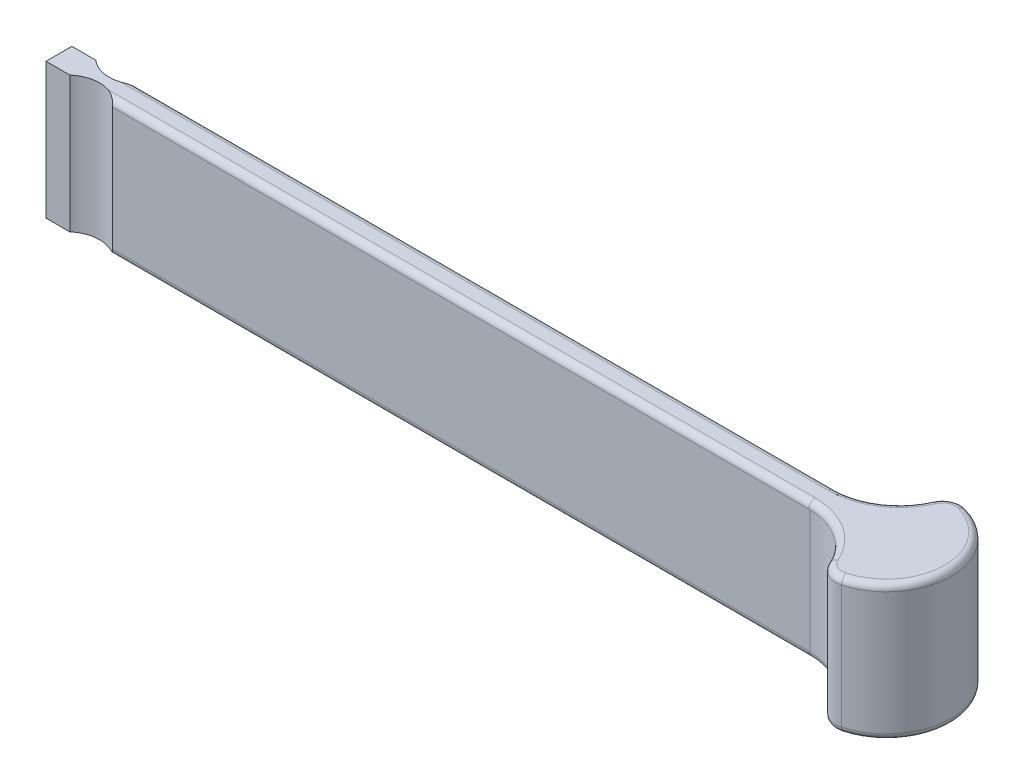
ISO-10303-21;
HEADER;
FILE_DESCRIPTION(('STEP AP214'),'2;1');
FILE_NAME('part.step','',(''),(''),'','','');
FILE_SCHEMA(('AUTOMOTIVE_DESIGN { 1 0 10303 214 1 1 1 1 }'));
ENDSEC;
DATA;
#1=APPLICATION_CONTEXT('core data for automotive mechanical design processes');
#2=APPLICATION_PROTOCOL_DEFINITION('international standard','automotive_design',2000,#1);
#3=PRODUCT_CONTEXT('',#1,'mechanical');
#4=PRODUCT('Part','Part','',(#3));
#5=PRODUCT_RELATED_PRODUCT_CATEGORY('part','',(#4));
#6=PRODUCT_DEFINITION_FORMATION('','',#4);
#7=PRODUCT_DEFINITION_CONTEXT('part definition',#1,'design');
#8=PRODUCT_DEFINITION('design','',#6,#7);
#9=PRODUCT_DEFINITION_SHAPE('','',#8);
#10=(LENGTH_UNIT() NAMED_UNIT(*) SI_UNIT(.MILLI.,.METRE.));
#11=(NAMED_UNIT(*) PLANE_ANGLE_UNIT() SI_UNIT($,.RADIAN.));
#12=(NAMED_UNIT(*) SI_UNIT($,.STERADIAN.) SOLID_ANGLE_UNIT());
#13=UNCERTAINTY_MEASURE_WITH_UNIT(LENGTH_MEASURE(1.E-05),#10,'distance_accuracy_value','');
#14=(GEOMETRIC_REPRESENTATION_CONTEXT(3) GLOBAL_UNCERTAINTY_ASSIGNED_CONTEXT((#13)) GLOBAL_UNIT_ASSIGNED_CONTEXT((#10,
#11,#12)) REPRESENTATION_CONTEXT('',''));
#15=CARTESIAN_POINT('',(0.,0.,0.));
#16=DIRECTION('',(0.,0.,1.));
#17=DIRECTION('',(1.,0.,0.));
#18=AXIS2_PLACEMENT_3D('',#15,#16,#17);
#19=CARTESIAN_POINT('',(0.,0.,4.));
#20=DIRECTION('',(0.,0.,1.));
#21=DIRECTION('',(1.,0.,0.));
#22=AXIS2_PLACEMENT_3D('',#19,#20,#21);
#23=PLANE('',#22);
#24=DIRECTION('',(1.,0.,0.));
#25=VECTOR('',#24,1.);
#26=CARTESIAN_POINT('',(73.220400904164,-9.5,4.));
#27=LINE('',#26,#25);
#28=CARTESIAN_POINT('',(-34.5826104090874,-9.5,4.));
#29=VERTEX_POINT('',#28);
#30=CARTESIAN_POINT('',(73.0183598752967,-9.5,4.));
#31=VERTEX_POINT('',#30);
#32=EDGE_CURVE('E424',#29,#31,#27,.T.);
#33=ORIENTED_EDGE('',*,*,#32,.T.);
#34=CARTESIAN_POINT('',(73.220400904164,-9.56385511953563,4.));
#35=CARTESIAN_POINT('',(73.1594072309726,-9.54458990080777,3.99999999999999));
#36=CARTESIAN_POINT('',(73.0984166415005,-9.5253149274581,3.99999999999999));
#37=CARTESIAN_POINT('',(73.0310726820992,-9.50402023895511,4.));
#38=CARTESIAN_POINT('',(73.0247162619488,-9.50201017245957,4.));
#39=CARTESIAN_POINT('',(73.0183598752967,-9.5,4.));
#40=B_SPLINE_CURVE_WITH_KNOTS('',3,(#34,#35,#36,#37,#38,#39),.UNSPECIFIED.,.F.,.F.,(4,2,4),(0.,
0.191891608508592,0.211891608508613),.UNSPECIFIED.);
#41=CARTESIAN_POINT('',(73.220400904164,-9.56385511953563,4.));
#42=VERTEX_POINT('',#41);
#43=EDGE_CURVE('E417',#31,#42,#40,.F.);
#44=ORIENTED_EDGE('',*,*,#43,.T.);
#45=DIRECTION('',(0.,1.,0.));
#46=VECTOR('',#45,1.);
#47=CARTESIAN_POINT('',(73.220400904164,-52.0224365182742,4.));
#48=LINE('',#47,#46);
#49=CARTESIAN_POINT('',(73.220400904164,9.56385511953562,4.));
#50=VERTEX_POINT('',#49);
#51=EDGE_CURVE('E251',#42,#50,#48,.T.);
#52=ORIENTED_EDGE('',*,*,#51,.T.);
#53=CARTESIAN_POINT('',(73.220400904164,9.56385511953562,4.));
#54=CARTESIAN_POINT('',(73.1594072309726,9.54458990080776,3.99999999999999));
#55=CARTESIAN_POINT('',(73.0984166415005,9.52531492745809,3.99999999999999));
#56=CARTESIAN_POINT('',(73.0310726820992,9.5040202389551,4.));
#57=CARTESIAN_POINT('',(73.0247162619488,9.50201017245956,4.));
#58=CARTESIAN_POINT('',(73.0183598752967,9.49999999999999,4.));
#59=B_SPLINE_CURVE_WITH_KNOTS('',3,(#53,#54,#55,#56,#57,#58),.UNSPECIFIED.,.F.,.F.,(4,2,4),(0.,
0.191891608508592,0.211891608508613),.UNSPECIFIED.);
#60=CARTESIAN_POINT('',(73.0183598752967,9.5,4.));
#61=VERTEX_POINT('',#60);
#62=EDGE_CURVE('E409',#50,#61,#59,.T.);
#63=ORIENTED_EDGE('',*,*,#62,.T.);
#64=DIRECTION('',(-1.,0.,0.));
#65=VECTOR('',#64,1.);
#66=CARTESIAN_POINT('',(-34.5826104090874,9.5,4.));
#67=LINE('',#66,#65);
#68=CARTESIAN_POINT('',(-34.5826104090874,9.49999999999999,4.));
#69=VERTEX_POINT('',#68);
#70=EDGE_CURVE('E479',#61,#69,#67,.T.);
#71=ORIENTED_EDGE('',*,*,#70,.T.);
#72=DIRECTION('',(0.,1.,0.));
#73=VECTOR('',#72,1.);
#74=CARTESIAN_POINT('',(-34.5826104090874,-10.5,4.));
#75=LINE('',#74,#73);
#76=EDGE_CURVE('E221',#29,#69,#75,.T.);
#77=ORIENTED_EDGE('',*,*,#76,.F.);
#78=EDGE_LOOP('',(#33,#44,#52,#63,#71,#77));
#79=FACE_BOUND('',#78,.T.);
#80=ADVANCED_FACE('F37',(#79),#23,.T.);
#81=CARTESIAN_POINT('',(0.,0.,0.));
#82=DIRECTION('',(0.,0.,1.));
#83=DIRECTION('',(1.,0.,0.));
#84=AXIS2_PLACEMENT_3D('',#81,#82,#83);
#85=PLANE('',#84);
#86=CARTESIAN_POINT('',(73.220400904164,-9.56385511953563,0.));
#87=CARTESIAN_POINT('',(73.1594072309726,-9.54458990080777,0.));
#88=CARTESIAN_POINT('',(73.0984166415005,-9.5253149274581,0.));
#89=CARTESIAN_POINT('',(73.0310726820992,-9.50402023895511,0.));
#90=CARTESIAN_POINT('',(73.0247162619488,-9.50201017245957,0.));
#91=CARTESIAN_POINT('',(73.0183598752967,-9.5,0.));
#92=B_SPLINE_CURVE_WITH_KNOTS('',3,(#86,#87,#88,#89,#90,#91),.UNSPECIFIED.,.F.,.F.,(4,2,4),(0.,
0.191891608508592,0.211891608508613),.UNSPECIFIED.);
#93=CARTESIAN_POINT('',(73.220400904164,-9.56385511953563,0.));
#94=VERTEX_POINT('',#93);
#95=CARTESIAN_POINT('',(73.0183598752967,-9.5,0.));
#96=VERTEX_POINT('',#95);
#97=EDGE_CURVE('E367',#94,#96,#92,.T.);
#98=ORIENTED_EDGE('',*,*,#97,.T.);
#99=DIRECTION('',(1.,0.,0.));
#100=VECTOR('',#99,1.);
#101=CARTESIAN_POINT('',(0.,-9.5,0.));
#102=LINE('',#101,#100);
#103=CARTESIAN_POINT('',(-34.5826104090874,-9.5,0.));
#104=VERTEX_POINT('',#103);
#105=EDGE_CURVE('E550',#96,#104,#102,.F.);
#106=ORIENTED_EDGE('',*,*,#105,.T.);
#107=DIRECTION('',(0.,1.,0.));
#108=VECTOR('',#107,1.);
#109=CARTESIAN_POINT('',(-34.5826104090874,-10.5,0.));
#110=LINE('',#109,#108);
#111=CARTESIAN_POINT('',(-34.5826104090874,9.49999999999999,0.));
#112=VERTEX_POINT('',#111);
#113=EDGE_CURVE('E222',#104,#112,#110,.T.);
#114=ORIENTED_EDGE('',*,*,#113,.T.);
#115=DIRECTION('',(-1.,0.,0.));
#116=VECTOR('',#115,1.);
#117=CARTESIAN_POINT('',(0.,9.5,0.));
#118=LINE('',#117,#116);
#119=CARTESIAN_POINT('',(73.0183598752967,9.5,0.));
#120=VERTEX_POINT('',#119);
#121=EDGE_CURVE('E359',#112,#120,#118,.F.);
#122=ORIENTED_EDGE('',*,*,#121,.T.);
#123=CARTESIAN_POINT('',(73.220400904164,9.56385511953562,0.));
#124=CARTESIAN_POINT('',(73.1594072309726,9.54458990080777,0.));
#125=CARTESIAN_POINT('',(73.0984166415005,9.5253149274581,0.));
#126=CARTESIAN_POINT('',(73.0310726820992,9.5040202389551,0.));
#127=CARTESIAN_POINT('',(73.0247162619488,9.50201017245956,0.));
#128=CARTESIAN_POINT('',(73.0183598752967,9.49999999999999,0.));
#129=B_SPLINE_CURVE_WITH_KNOTS('',3,(#123,#124,#125,#126,#127,#128),.UNSPECIFIED.,.F.,.F.,(4,2,
4),(0.,0.191891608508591,0.211891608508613),.UNSPECIFIED.);
#130=CARTESIAN_POINT('',(73.220400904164,9.56385511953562,0.));
#131=VERTEX_POINT('',#130);
#132=EDGE_CURVE('E361',#120,#131,#129,.F.);
#133=ORIENTED_EDGE('',*,*,#132,.T.);
#134=DIRECTION('',(0.,1.,0.));
#135=VECTOR('',#134,1.);
#136=CARTESIAN_POINT('',(73.220400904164,-52.0224365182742,0.));
#137=LINE('',#136,#135);
#138=EDGE_CURVE('E248',#94,#131,#137,.T.);
#139=ORIENTED_EDGE('',*,*,#138,.F.);
#140=EDGE_LOOP('',(#98,#106,#114,#122,#133,#139));
#141=FACE_BOUND('',#140,.T.);
#142=ADVANCED_FACE('F556',(#141),#85,.F.);
#143=CARTESIAN_POINT('',(-150.,10.5,4.));
#144=DIRECTION('',(0.,-1.,0.));
#145=DIRECTION('',(0.,0.,-1.));
#146=AXIS2_PLACEMENT_3D('',#143,#144,#145);
#147=PLANE('',#146);
#148=CARTESIAN_POINT('',(-37.8897995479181,10.5,7.75));
#149=DIRECTION('',(0.,1.,0.));
#150=DIRECTION('',(0.,0.,-1.));
#151=AXIS2_PLACEMENT_3D('',#148,#149,#150);
#152=CIRCLE('',#151,5.);
#153=CARTESIAN_POINT('',(-36.3285500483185,10.5,3.));
#154=VERTEX_POINT('',#153);
#155=CARTESIAN_POINT('',(-41.1969886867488,10.5,4.));
#156=VERTEX_POINT('',#155);
#157=EDGE_CURVE('E213',#154,#156,#152,.T.);
#158=ORIENTED_EDGE('',*,*,#157,.F.);
#159=DIRECTION('',(-1.,0.,0.));
#160=VECTOR('',#159,1.);
#161=CARTESIAN_POINT('',(73.220400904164,10.5,3.));
#162=LINE('',#161,#160);
#163=CARTESIAN_POINT('',(73.0183598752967,10.5,3.00000000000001));
#164=VERTEX_POINT('',#163);
#165=EDGE_CURVE('E357',#154,#164,#162,.F.);
#166=ORIENTED_EDGE('',*,*,#165,.T.);
#167=CARTESIAN_POINT('',(73.0183598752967,10.5,14.));
#168=DIRECTION('',(0.,-1.,0.));
#169=DIRECTION('',(0.,0.,-1.));
#170=AXIS2_PLACEMENT_3D('',#167,#168,#169);
#171=CIRCLE('',#170,11.);
#172=CARTESIAN_POINT('',(83.0778796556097,10.5,9.54959981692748));
#173=VERTEX_POINT('',#172);
#174=EDGE_CURVE('E354',#164,#173,#171,.T.);
#175=ORIENTED_EDGE('',*,*,#174,.T.);
#176=CARTESIAN_POINT('',(84.9068832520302,10.5,8.74043614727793));
#177=DIRECTION('',(0.,-1.,0.));
#178=DIRECTION('',(0.,0.,-1.));
#179=AXIS2_PLACEMENT_3D('',#176,#177,#178);
#180=CIRCLE('',#179,2.);
#181=CARTESIAN_POINT('',(85.4464613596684,10.5,10.6662750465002));
#182=VERTEX_POINT('',#181);
#183=EDGE_CURVE('E352',#173,#182,#180,.F.);
#184=ORIENTED_EDGE('',*,*,#183,.T.);
#185=CARTESIAN_POINT('',(83.0183598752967,10.5,2.));
#186=DIRECTION('',(0.,-1.,0.));
#187=DIRECTION('',(0.,0.,-1.));
#188=AXIS2_PLACEMENT_3D('',#185,#186,#187);
#189=CIRCLE('',#188,9.);
#190=CARTESIAN_POINT('',(85.4464613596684,10.5,-6.6662750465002));
#191=VERTEX_POINT('',#190);
#192=EDGE_CURVE('E350',#182,#191,#189,.F.);
#193=ORIENTED_EDGE('',*,*,#192,.T.);
#194=CARTESIAN_POINT('',(84.9068832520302,10.5,-4.74043614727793));
#195=DIRECTION('',(0.,-1.,0.));
#196=DIRECTION('',(0.,0.,-1.));
#197=AXIS2_PLACEMENT_3D('',#194,#195,#196);
#198=CIRCLE('',#197,2.);
#199=CARTESIAN_POINT('',(83.0778796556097,10.5,-5.54959981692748));
#200=VERTEX_POINT('',#199);
#201=EDGE_CURVE('E348',#191,#200,#198,.F.);
#202=ORIENTED_EDGE('',*,*,#201,.T.);
#203=CARTESIAN_POINT('',(73.0183598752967,10.5,-10.));
#204=DIRECTION('',(0.,-1.,0.));
#205=DIRECTION('',(0.,0.,-1.));
#206=AXIS2_PLACEMENT_3D('',#203,#204,#205);
#207=CIRCLE('',#206,11.);
#208=CARTESIAN_POINT('',(73.0183598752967,10.5,1.));
#209=VERTEX_POINT('',#208);
#210=EDGE_CURVE('E342',#200,#209,#207,.T.);
#211=ORIENTED_EDGE('',*,*,#210,.T.);
#212=DIRECTION('',(-1.,0.,0.));
#213=VECTOR('',#212,1.);
#214=CARTESIAN_POINT('',(-150.,10.5,1.));
#215=LINE('',#214,#213);
#216=CARTESIAN_POINT('',(-36.3285500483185,10.5,1.));
#217=VERTEX_POINT('',#216);
#218=EDGE_CURVE('E339',#209,#217,#215,.T.);
#219=ORIENTED_EDGE('',*,*,#218,.T.);
#220=CARTESIAN_POINT('',(-37.8897995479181,10.5,-3.75));
#221=DIRECTION('',(0.,1.,0.));
#222=DIRECTION('',(0.,0.,1.));
#223=AXIS2_PLACEMENT_3D('',#220,#221,#222);
#224=CIRCLE('',#223,5.);
#225=CARTESIAN_POINT('',(-41.1969886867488,10.5,0.));
#226=VERTEX_POINT('',#225);
#227=EDGE_CURVE('E212',#226,#217,#224,.T.);
#228=ORIENTED_EDGE('',*,*,#227,.F.);
#229=DIRECTION('',(-1.,0.,0.));
#230=VECTOR('',#229,1.);
#231=CARTESIAN_POINT('',(-150.,10.5,0.));
#232=LINE('',#231,#230);
#233=CARTESIAN_POINT('',(-44.8897995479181,10.5,0.));
#234=VERTEX_POINT('',#233);
#235=EDGE_CURVE('E243',#226,#234,#232,.T.);
#236=ORIENTED_EDGE('',*,*,#235,.T.);
#237=DIRECTION('',(0.,0.,1.));
#238=VECTOR('',#237,1.);
#239=CARTESIAN_POINT('',(-44.8897995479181,10.5,4.));
#240=LINE('',#239,#238);
#241=CARTESIAN_POINT('',(-44.8897995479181,10.5,4.));
#242=VERTEX_POINT('',#241);
#243=EDGE_CURVE('E249',#234,#242,#240,.T.);
#244=ORIENTED_EDGE('',*,*,#243,.T.);
#245=DIRECTION('',(-1.,0.,0.));
#246=VECTOR('',#245,1.);
#247=CARTESIAN_POINT('',(-150.,10.5,4.));
#248=LINE('',#247,#246);
#249=EDGE_CURVE('E229',#156,#242,#248,.T.);
#250=ORIENTED_EDGE('',*,*,#249,.F.);
#251=EDGE_LOOP('',(#158,#166,#175,#184,#193,#202,#211,#219,#228,#236,#244,#250));
#252=FACE_BOUND('',#251,.T.);
#253=ADVANCED_FACE('F507',(#252),#147,.F.);
#254=CARTESIAN_POINT('',(-150.,-10.5,4.));
#255=DIRECTION('',(0.,1.,0.));
#256=DIRECTION('',(-1.,0.,0.));
#257=AXIS2_PLACEMENT_3D('',#254,#255,#256);
#258=PLANE('',#257);
#259=CARTESIAN_POINT('',(73.0183598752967,-10.5,14.));
#260=DIRECTION('',(0.,1.,0.));
#261=DIRECTION('',(-1.,0.,0.));
#262=AXIS2_PLACEMENT_3D('',#259,#260,#261);
#263=CIRCLE('',#262,11.);
#264=CARTESIAN_POINT('',(83.0778796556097,-10.5,9.54959981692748));
#265=VERTEX_POINT('',#264);
#266=CARTESIAN_POINT('',(73.0183598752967,-10.5,3.00000000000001));
#267=VERTEX_POINT('',#266);
#268=EDGE_CURVE('E477',#265,#267,#263,.T.);
#269=ORIENTED_EDGE('',*,*,#268,.T.);
#270=DIRECTION('',(1.,0.,0.));
#271=VECTOR('',#270,1.);
#272=CARTESIAN_POINT('',(-34.5826104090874,-10.5,3.));
#273=LINE('',#272,#271);
#274=CARTESIAN_POINT('',(-36.3285500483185,-10.5,3.));
#275=VERTEX_POINT('',#274);
#276=EDGE_CURVE('E209',#267,#275,#273,.F.);
#277=ORIENTED_EDGE('',*,*,#276,.T.);
#278=CARTESIAN_POINT('',(-37.8897995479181,-10.5,7.75));
#279=DIRECTION('',(0.,1.,0.));
#280=DIRECTION('',(0.,0.,-1.));
#281=AXIS2_PLACEMENT_3D('',#278,#279,#280);
#282=CIRCLE('',#281,5.);
#283=CARTESIAN_POINT('',(-41.1969886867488,-10.5,4.));
#284=VERTEX_POINT('',#283);
#285=EDGE_CURVE('E201',#275,#284,#282,.T.);
#286=ORIENTED_EDGE('',*,*,#285,.T.);
#287=DIRECTION('',(1.,0.,0.));
#288=VECTOR('',#287,1.);
#289=CARTESIAN_POINT('',(-150.,-10.5,4.));
#290=LINE('',#289,#288);
#291=CARTESIAN_POINT('',(-44.8897995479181,-10.5,4.));
#292=VERTEX_POINT('',#291);
#293=EDGE_CURVE('E207',#292,#284,#290,.T.);
#294=ORIENTED_EDGE('',*,*,#293,.F.);
#295=DIRECTION('',(0.,0.,-1.));
#296=VECTOR('',#295,1.);
#297=CARTESIAN_POINT('',(-44.8897995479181,-10.5,38.));
#298=LINE('',#297,#296);
#299=CARTESIAN_POINT('',(-44.8897995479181,-10.5,0.));
#300=VERTEX_POINT('',#299);
#301=EDGE_CURVE('E259',#292,#300,#298,.T.);
#302=ORIENTED_EDGE('',*,*,#301,.T.);
#303=DIRECTION('',(1.,0.,0.));
#304=VECTOR('',#303,1.);
#305=CARTESIAN_POINT('',(-150.,-10.5,0.));
#306=LINE('',#305,#304);
#307=CARTESIAN_POINT('',(-41.1969886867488,-10.5,0.));
#308=VERTEX_POINT('',#307);
#309=EDGE_CURVE('E233',#300,#308,#306,.T.);
#310=ORIENTED_EDGE('',*,*,#309,.T.);
#311=CARTESIAN_POINT('',(-37.8897995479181,-10.5,-3.75));
#312=DIRECTION('',(0.,1.,0.));
#313=DIRECTION('',(0.,0.,1.));
#314=AXIS2_PLACEMENT_3D('',#311,#312,#313);
#315=CIRCLE('',#314,5.);
#316=CARTESIAN_POINT('',(-36.3285500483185,-10.5,1.));
#317=VERTEX_POINT('',#316);
#318=EDGE_CURVE('E263',#308,#317,#315,.T.);
#319=ORIENTED_EDGE('',*,*,#318,.T.);
#320=DIRECTION('',(1.,0.,0.));
#321=VECTOR('',#320,1.);
#322=CARTESIAN_POINT('',(-150.,-10.5,1.));
#323=LINE('',#322,#321);
#324=CARTESIAN_POINT('',(73.0183598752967,-10.5,0.999999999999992));
#325=VERTEX_POINT('',#324);
#326=EDGE_CURVE('E471',#317,#325,#323,.T.);
#327=ORIENTED_EDGE('',*,*,#326,.T.);
#328=CARTESIAN_POINT('',(73.0183598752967,-10.5,-10.));
#329=DIRECTION('',(0.,1.,0.));
#330=DIRECTION('',(-1.,0.,0.));
#331=AXIS2_PLACEMENT_3D('',#328,#329,#330);
#332=CIRCLE('',#331,11.);
#333=CARTESIAN_POINT('',(83.0778796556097,-10.5,-5.54959981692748));
#334=VERTEX_POINT('',#333);
#335=EDGE_CURVE('E469',#325,#334,#332,.T.);
#336=ORIENTED_EDGE('',*,*,#335,.T.);
#337=CARTESIAN_POINT('',(84.9068832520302,-10.5,-4.74043614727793));
#338=DIRECTION('',(0.,1.,0.));
#339=DIRECTION('',(-1.,0.,0.));
#340=AXIS2_PLACEMENT_3D('',#337,#338,#339);
#341=CIRCLE('',#340,2.);
#342=CARTESIAN_POINT('',(85.4464613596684,-10.5,-6.6662750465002));
#343=VERTEX_POINT('',#342);
#344=EDGE_CURVE('E333',#334,#343,#341,.F.);
#345=ORIENTED_EDGE('',*,*,#344,.T.);
#346=CARTESIAN_POINT('',(83.0183598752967,-10.5,2.));
#347=DIRECTION('',(0.,1.,0.));
#348=DIRECTION('',(-1.,0.,0.));
#349=AXIS2_PLACEMENT_3D('',#346,#347,#348);
#350=CIRCLE('',#349,9.);
#351=CARTESIAN_POINT('',(85.4464613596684,-10.5,10.6662750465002));
#352=VERTEX_POINT('',#351);
#353=EDGE_CURVE('E328',#343,#352,#350,.F.);
#354=ORIENTED_EDGE('',*,*,#353,.T.);
#355=CARTESIAN_POINT('',(84.9068832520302,-10.5,8.74043614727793));
#356=DIRECTION('',(0.,1.,0.));
#357=DIRECTION('',(-1.,0.,0.));
#358=AXIS2_PLACEMENT_3D('',#355,#356,#357);
#359=CIRCLE('',#358,2.);
#360=EDGE_CURVE('E475',#352,#265,#359,.F.);
#361=ORIENTED_EDGE('',*,*,#360,.T.);
#362=EDGE_LOOP('',(#269,#277,#286,#294,#302,#310,#319,#327,#336,#345,#354,#361));
#363=FACE_BOUND('',#362,.T.);
#364=ADVANCED_FACE('F204',(#363),#258,.F.);
#365=DIRECTION('',(0.,1.,0.));
#366=VECTOR('',#365,1.);
#367=CARTESIAN_POINT('',(-41.1969886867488,-10.5,4.));
#368=LINE('',#367,#366);
#369=EDGE_CURVE('E216',#156,#284,#368,.F.);
#370=ORIENTED_EDGE('',*,*,#369,.F.);
#371=ORIENTED_EDGE('',*,*,#249,.T.);
#372=DIRECTION('',(0.,1.,0.));
#373=VECTOR('',#372,1.);
#374=CARTESIAN_POINT('',(-44.8897995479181,0.,4.));
#375=LINE('',#374,#373);
#376=EDGE_CURVE('E227',#292,#242,#375,.T.);
#377=ORIENTED_EDGE('',*,*,#376,.F.);
#378=ORIENTED_EDGE('',*,*,#293,.T.);
#379=EDGE_LOOP('',(#370,#371,#377,#378));
#380=FACE_BOUND('',#379,.T.);
#381=ADVANCED_FACE('F225',(#380),#23,.T.);
#382=ORIENTED_EDGE('',*,*,#235,.F.);
#383=DIRECTION('',(0.,1.,0.));
#384=VECTOR('',#383,1.);
#385=CARTESIAN_POINT('',(-41.1969886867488,-10.5,0.));
#386=LINE('',#385,#384);
#387=EDGE_CURVE('E228',#226,#308,#386,.F.);
#388=ORIENTED_EDGE('',*,*,#387,.T.);
#389=ORIENTED_EDGE('',*,*,#309,.F.);
#390=DIRECTION('',(0.,-1.,0.));
#391=VECTOR('',#390,1.);
#392=CARTESIAN_POINT('',(-44.8897995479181,-10.5,0.));
#393=LINE('',#392,#391);
#394=EDGE_CURVE('E261',#234,#300,#393,.T.);
#395=ORIENTED_EDGE('',*,*,#394,.F.);
#396=EDGE_LOOP('',(#382,#388,#389,#395));
#397=FACE_BOUND('',#396,.T.);
#398=ADVANCED_FACE('F372',(#397),#85,.F.);
#399=CARTESIAN_POINT('',(73.0183598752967,-52.0224365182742,-10.));
#400=DIRECTION('',(0.,1.,0.));
#401=DIRECTION('',(0.,0.,1.));
#402=AXIS2_PLACEMENT_3D('',#399,#400,#401);
#403=CYLINDRICAL_SURFACE('',#402,9.99999999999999);
#404=DIRECTION('',(0.,1.,0.));
#405=VECTOR('',#404,1.);
#406=CARTESIAN_POINT('',(82.1633778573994,-52.0224365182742,-5.95418165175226));
#407=LINE('',#406,#405);
#408=CARTESIAN_POINT('',(82.1633778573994,9.49999999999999,-5.95418165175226));
#409=VERTEX_POINT('',#408);
#410=CARTESIAN_POINT('',(82.1633778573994,-9.5,-5.95418165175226));
#411=VERTEX_POINT('',#410);
#412=EDGE_CURVE('E462',#409,#411,#407,.F.);
#413=ORIENTED_EDGE('',*,*,#412,.T.);
#414=CARTESIAN_POINT('',(73.0183598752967,-9.5,-10.));
#415=DIRECTION('',(0.,1.,0.));
#416=DIRECTION('',(-1.,0.,0.));
#417=AXIS2_PLACEMENT_3D('',#414,#415,#416);
#418=CIRCLE('',#417,9.99999999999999);
#419=CARTESIAN_POINT('',(73.220819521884,-9.5,-0.00204970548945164));
#420=VERTEX_POINT('',#419);
#421=EDGE_CURVE('E61',#411,#420,#418,.F.);
#422=ORIENTED_EDGE('',*,*,#421,.T.);
#423=DIRECTION('',(0.,1.,0.));
#424=VECTOR('',#423,1.);
#425=CARTESIAN_POINT('',(73.220819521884,-52.0224365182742,-0.00204970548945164));
#426=LINE('',#425,#424);
#427=CARTESIAN_POINT('',(73.220819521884,9.49999999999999,-0.00204970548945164));
#428=VERTEX_POINT('',#427);
#429=EDGE_CURVE('E246',#420,#428,#426,.T.);
#430=ORIENTED_EDGE('',*,*,#429,.T.);
#431=CARTESIAN_POINT('',(73.0183598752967,9.49999999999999,-10.));
#432=DIRECTION('',(0.,-1.,0.));
#433=DIRECTION('',(0.,0.,-1.));
#434=AXIS2_PLACEMENT_3D('',#431,#432,#433);
#435=CIRCLE('',#434,9.99999999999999);
#436=EDGE_CURVE('E517',#428,#409,#435,.F.);
#437=ORIENTED_EDGE('',*,*,#436,.T.);
#438=EDGE_LOOP('',(#413,#422,#430,#437));
#439=FACE_BOUND('',#438,.T.);
#440=ADVANCED_FACE('F394',(#439),#403,.F.);
#441=CARTESIAN_POINT('',(83.0183598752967,-52.0224365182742,2.));
#442=DIRECTION('',(0.,1.,0.));
#443=DIRECTION('',(0.,0.,1.));
#444=AXIS2_PLACEMENT_3D('',#441,#442,#443);
#445=CYLINDRICAL_SURFACE('',#444,10.);
#446=ORIENTED_EDGE('',*,*,#429,.F.);
#447=CARTESIAN_POINT('',(73.220819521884,-9.5,-0.00204970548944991));
#448=CARTESIAN_POINT('',(73.2208194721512,-9.51065393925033,-0.00204959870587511));
#449=CARTESIAN_POINT('',(73.2207845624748,-9.5213021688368,-0.00187873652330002));
#450=CARTESIAN_POINT('',(73.2206450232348,-9.54258720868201,-0.00119550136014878));
#451=CARTESIAN_POINT('',(73.2205403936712,-9.55322401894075,-0.000683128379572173));
#452=CARTESIAN_POINT('',(73.220400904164,-9.56385511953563,0.));
#453=B_SPLINE_CURVE_WITH_KNOTS('',3,(#447,#448,#449,#450,#451,#452),.UNSPECIFIED.,.F.,.F.,(4,2,
4),(0.,0.0319489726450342,0.0638979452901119),.UNSPECIFIED.);
#454=EDGE_CURVE('E11',#420,#94,#453,.T.);
#455=ORIENTED_EDGE('',*,*,#454,.T.);
#456=ORIENTED_EDGE('',*,*,#138,.T.);
#457=CARTESIAN_POINT('',(73.220400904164,9.56385511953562,0.));
#458=CARTESIAN_POINT('',(73.2205403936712,9.55322401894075,-0.000683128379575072));
#459=CARTESIAN_POINT('',(73.2206450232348,9.542587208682,-0.00119550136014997));
#460=CARTESIAN_POINT('',(73.2207845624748,9.52130216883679,-0.00187873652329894));
#461=CARTESIAN_POINT('',(73.2208194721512,9.51065393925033,-0.00204959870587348));
#462=CARTESIAN_POINT('',(73.220819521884,9.49999999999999,-0.0020497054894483));
#463=B_SPLINE_CURVE_WITH_KNOTS('',3,(#457,#458,#459,#460,#461,#462),.UNSPECIFIED.,.F.,.F.,(4,2,
4),(0.,0.0319489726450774,0.0638979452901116),.UNSPECIFIED.);
#464=EDGE_CURVE('E47',#131,#428,#463,.T.);
#465=ORIENTED_EDGE('',*,*,#464,.T.);
#466=EDGE_LOOP('',(#446,#455,#456,#465));
#467=FACE_BOUND('',#466,.T.);
#468=ADVANCED_FACE('F388',(#467),#445,.T.);
#469=CARTESIAN_POINT('',(83.0183598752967,-52.0224365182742,2.));
#470=DIRECTION('',(0.,1.,0.));
#471=DIRECTION('',(0.,0.,1.));
#472=AXIS2_PLACEMENT_3D('',#469,#470,#471);
#473=CYLINDRICAL_SURFACE('',#472,10.);
#474=ORIENTED_EDGE('',*,*,#51,.F.);
#475=CARTESIAN_POINT('',(73.220400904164,-9.56385511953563,4.));
#476=CARTESIAN_POINT('',(73.2205403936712,-9.55322401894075,4.00068312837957));
#477=CARTESIAN_POINT('',(73.2206450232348,-9.54258720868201,4.00119550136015));
#478=CARTESIAN_POINT('',(73.2207845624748,-9.5213021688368,4.0018787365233));
#479=CARTESIAN_POINT('',(73.2208194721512,-9.51065393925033,4.00204959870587));
#480=CARTESIAN_POINT('',(73.220819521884,-9.5,4.00204970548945));
#481=B_SPLINE_CURVE_WITH_KNOTS('',3,(#475,#476,#477,#478,#479,#480),.UNSPECIFIED.,.F.,.F.,(4,2,
4),(0.,0.0319489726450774,0.0638979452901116),.UNSPECIFIED.);
#482=CARTESIAN_POINT('',(73.220819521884,-9.5,4.00204970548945));
#483=VERTEX_POINT('',#482);
#484=EDGE_CURVE('E440',#42,#483,#481,.T.);
#485=ORIENTED_EDGE('',*,*,#484,.T.);
#486=DIRECTION('',(0.,1.,0.));
#487=VECTOR('',#486,1.);
#488=CARTESIAN_POINT('',(73.220819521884,-52.0224365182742,4.00204970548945));
#489=LINE('',#488,#487);
#490=CARTESIAN_POINT('',(73.220819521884,9.49999999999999,4.00204970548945));
#491=VERTEX_POINT('',#490);
#492=EDGE_CURVE('E245',#483,#491,#489,.T.);
#493=ORIENTED_EDGE('',*,*,#492,.T.);
#494=CARTESIAN_POINT('',(73.220819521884,9.49999999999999,4.00204970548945));
#495=CARTESIAN_POINT('',(73.2208194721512,9.51065393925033,4.00204959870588));
#496=CARTESIAN_POINT('',(73.2207845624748,9.52130216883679,4.0018787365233));
#497=CARTESIAN_POINT('',(73.2206450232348,9.542587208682,4.00119550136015));
#498=CARTESIAN_POINT('',(73.2205403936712,9.55322401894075,4.00068312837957));
#499=CARTESIAN_POINT('',(73.220400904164,9.56385511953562,3.99999999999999));
#500=B_SPLINE_CURVE_WITH_KNOTS('',3,(#494,#495,#496,#497,#498,#499),.UNSPECIFIED.,.F.,.F.,(4,2,
4),(0.,0.0319489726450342,0.0638979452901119),.UNSPECIFIED.);
#501=EDGE_CURVE('E423',#491,#50,#500,.T.);
#502=ORIENTED_EDGE('',*,*,#501,.T.);
#503=EDGE_LOOP('',(#474,#485,#493,#502));
#504=FACE_BOUND('',#503,.T.);
#505=ADVANCED_FACE('F393',(#504),#473,.T.);
#506=CARTESIAN_POINT('',(73.0183598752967,-52.0224365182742,14.));
#507=DIRECTION('',(0.,1.,0.));
#508=DIRECTION('',(0.,0.,1.));
#509=AXIS2_PLACEMENT_3D('',#506,#507,#508);
#510=CYLINDRICAL_SURFACE('',#509,9.99999999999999);
#511=ORIENTED_EDGE('',*,*,#492,.F.);
#512=CARTESIAN_POINT('',(73.0183598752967,-9.5,14.));
#513=DIRECTION('',(0.,1.,0.));
#514=DIRECTION('',(-1.,0.,0.));
#515=AXIS2_PLACEMENT_3D('',#512,#513,#514);
#516=CIRCLE('',#515,9.99999999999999);
#517=CARTESIAN_POINT('',(82.1633778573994,-9.5,9.95418165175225));
#518=VERTEX_POINT('',#517);
#519=EDGE_CURVE('E447',#483,#518,#516,.F.);
#520=ORIENTED_EDGE('',*,*,#519,.T.);
#521=DIRECTION('',(0.,1.,0.));
#522=VECTOR('',#521,1.);
#523=CARTESIAN_POINT('',(82.1633778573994,-52.0224365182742,9.95418165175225));
#524=LINE('',#523,#522);
#525=CARTESIAN_POINT('',(82.1633778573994,9.49999999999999,9.95418165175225));
#526=VERTEX_POINT('',#525);
#527=EDGE_CURVE('E460',#518,#526,#524,.T.);
#528=ORIENTED_EDGE('',*,*,#527,.T.);
#529=CARTESIAN_POINT('',(73.0183598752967,9.49999999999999,14.));
#530=DIRECTION('',(0.,-1.,0.));
#531=DIRECTION('',(0.,0.,-1.));
#532=AXIS2_PLACEMENT_3D('',#529,#530,#531);
#533=CIRCLE('',#532,9.99999999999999);
#534=EDGE_CURVE('E445',#526,#491,#533,.F.);
#535=ORIENTED_EDGE('',*,*,#534,.T.);
#536=EDGE_LOOP('',(#511,#520,#528,#535));
#537=FACE_BOUND('',#536,.T.);
#538=ADVANCED_FACE('F403',(#537),#510,.F.);
#539=CARTESIAN_POINT('',(83.0183598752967,-52.0224365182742,2.));
#540=DIRECTION('',(0.,1.,0.));
#541=DIRECTION('',(0.,0.,1.));
#542=AXIS2_PLACEMENT_3D('',#539,#540,#541);
#543=CYLINDRICAL_SURFACE('',#542,10.);
#544=DIRECTION('',(0.,1.,0.));
#545=VECTOR('',#544,1.);
#546=CARTESIAN_POINT('',(85.7162504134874,-52.0224365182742,11.6291944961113));
#547=LINE('',#546,#545);
#548=CARTESIAN_POINT('',(85.7162504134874,9.49999999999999,11.6291944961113));
#549=VERTEX_POINT('',#548);
#550=CARTESIAN_POINT('',(85.7162504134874,-9.5,11.6291944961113));
#551=VERTEX_POINT('',#550);
#552=EDGE_CURVE('E459',#549,#551,#547,.F.);
#553=ORIENTED_EDGE('',*,*,#552,.T.);
#554=CARTESIAN_POINT('',(83.0183598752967,-9.5,2.));
#555=DIRECTION('',(0.,1.,0.));
#556=DIRECTION('',(-1.,0.,0.));
#557=AXIS2_PLACEMENT_3D('',#554,#555,#556);
#558=CIRCLE('',#557,10.);
#559=CARTESIAN_POINT('',(85.7162504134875,-9.5,-7.62919449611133));
#560=VERTEX_POINT('',#559);
#561=EDGE_CURVE('E327',#551,#560,#558,.T.);
#562=ORIENTED_EDGE('',*,*,#561,.T.);
#563=DIRECTION('',(0.,1.,0.));
#564=VECTOR('',#563,1.);
#565=CARTESIAN_POINT('',(85.7162504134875,-52.0224365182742,-7.62919449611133));
#566=LINE('',#565,#564);
#567=CARTESIAN_POINT('',(85.7162504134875,9.49999999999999,-7.62919449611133));
#568=VERTEX_POINT('',#567);
#569=EDGE_CURVE('E456',#560,#568,#566,.T.);
#570=ORIENTED_EDGE('',*,*,#569,.T.);
#571=CARTESIAN_POINT('',(83.0183598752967,9.49999999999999,2.));
#572=DIRECTION('',(0.,-1.,0.));
#573=DIRECTION('',(0.,0.,-1.));
#574=AXIS2_PLACEMENT_3D('',#571,#572,#573);
#575=CIRCLE('',#574,10.);
#576=EDGE_CURVE('E453',#568,#549,#575,.T.);
#577=ORIENTED_EDGE('',*,*,#576,.T.);
#578=EDGE_LOOP('',(#553,#562,#570,#577));
#579=FACE_BOUND('',#578,.T.);
#580=ADVANCED_FACE('F400',(#579),#543,.T.);
#581=CARTESIAN_POINT('',(-44.8897995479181,-10.5,38.));
#582=DIRECTION('',(1.,0.,0.));
#583=DIRECTION('',(0.,0.,-1.));
#584=AXIS2_PLACEMENT_3D('',#581,#582,#583);
#585=PLANE('',#584);
#586=ORIENTED_EDGE('',*,*,#394,.T.);
#587=ORIENTED_EDGE('',*,*,#301,.F.);
#588=ORIENTED_EDGE('',*,*,#376,.T.);
#589=ORIENTED_EDGE('',*,*,#243,.F.);
#590=EDGE_LOOP('',(#586,#587,#588,#589));
#591=FACE_BOUND('',#590,.T.);
#592=ADVANCED_FACE('F402',(#591),#585,.F.);
#593=CARTESIAN_POINT('',(-37.8897995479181,-10.5,-3.75));
#594=DIRECTION('',(0.,1.,0.));
#595=DIRECTION('',(0.,0.,1.));
#596=AXIS2_PLACEMENT_3D('',#593,#594,#595);
#597=CYLINDRICAL_SURFACE('',#596,5.);
#598=ORIENTED_EDGE('',*,*,#113,.F.);
#599=CARTESIAN_POINT('',(-34.5826104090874,-9.5,0.));
#600=CARTESIAN_POINT('',(-34.5826086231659,-9.52098811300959,-2.90151193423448E-06));
#601=CARTESIAN_POINT('',(-34.5833602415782,-9.54196337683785,0.000661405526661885));
#602=CARTESIAN_POINT('',(-34.5863449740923,-9.58371207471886,0.00329107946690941));
#603=CARTESIAN_POINT('',(-34.5885770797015,-9.60448563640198,0.00525556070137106));
#604=CARTESIAN_POINT('',(-34.5974045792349,-9.66591277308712,0.013003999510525));
#605=CARTESIAN_POINT('',(-34.6061322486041,-9.70605539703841,0.0206442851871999));
#606=CARTESIAN_POINT('',(-34.6287481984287,-9.78358719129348,0.0402192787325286));
#607=CARTESIAN_POINT('',(-34.6426247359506,-9.82098239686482,0.052144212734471));
#608=CARTESIAN_POINT('',(-34.6748642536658,-9.89248520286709,0.0794436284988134));
#609=CARTESIAN_POINT('',(-34.6932361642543,-9.92658606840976,0.0948249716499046));
#610=CARTESIAN_POINT('',(-34.7412785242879,-10.0031055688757,0.134340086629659));
#611=CARTESIAN_POINT('',(-34.7726091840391,-10.0438960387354,0.159600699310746));
#612=CARTESIAN_POINT('',(-34.8406549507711,-10.1185391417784,0.21290291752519));
#613=CARTESIAN_POINT('',(-34.877379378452,-10.1523795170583,0.240949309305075));
#614=CARTESIAN_POINT('',(-34.9743233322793,-10.2290681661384,0.312658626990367));
#615=CARTESIAN_POINT('',(-35.0370940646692,-10.2679317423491,0.357103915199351));
#616=CARTESIAN_POINT('',(-35.1687541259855,-10.334021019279,0.445504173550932));
#617=CARTESIAN_POINT('',(-35.2376573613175,-10.3612194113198,0.489457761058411));
#618=CARTESIAN_POINT('',(-35.3707771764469,-10.4036750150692,0.569698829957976));
#619=CARTESIAN_POINT('',(-35.434502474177,-10.4200001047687,0.606257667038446));
#620=CARTESIAN_POINT('',(-35.5644419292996,-10.447152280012,0.676984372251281));
#621=CARTESIAN_POINT('',(-35.6306581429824,-10.4579747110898,0.711150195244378));
#622=CARTESIAN_POINT('',(-35.7650600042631,-10.4753411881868,0.776707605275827));
#623=CARTESIAN_POINT('',(-35.8332476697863,-10.4818806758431,0.808096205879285));
#624=CARTESIAN_POINT('',(-35.9711275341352,-10.4916884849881,0.867828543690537));
#625=CARTESIAN_POINT('',(-36.0408190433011,-10.4949582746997,0.896173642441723));
#626=CARTESIAN_POINT('',(-36.1471173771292,-10.4980845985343,0.936634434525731));
#627=CARTESIAN_POINT('',(-36.1832629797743,-10.4988281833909,0.949916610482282));
#628=CARTESIAN_POINT('',(-36.2557433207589,-10.4997845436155,0.975604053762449));
#629=CARTESIAN_POINT('',(-36.2920771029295,-10.4999989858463,0.988011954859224));
#630=CARTESIAN_POINT('',(-36.3285500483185,-10.5,1.));
#631=B_SPLINE_CURVE_WITH_KNOTS('',3,(#599,#600,#601,#602,#603,#604,#605,#606,#607,#608,#609,
#610,#611,#612,#613,#614,#615,#616,#617,#618,#619,#620,#621,#622,#623,#624,#625,#626,#627,#628,
#629,#630),.UNSPECIFIED.,.F.,.F.,(4,2,2,2,2,2,2,2,2,2,2,2,2,2,2,4),(0.,0.0629158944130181,
0.125788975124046,0.250405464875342,0.374739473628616,0.499322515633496,0.670274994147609,
0.84152644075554,1.09860021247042,1.35627256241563,1.58172557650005,1.807368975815,
2.03325214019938,2.2590338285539,2.37456988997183,2.48974153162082),.UNSPECIFIED.);
#632=EDGE_CURVE('E515',#104,#317,#631,.T.);
#633=ORIENTED_EDGE('',*,*,#632,.T.);
#634=ORIENTED_EDGE('',*,*,#318,.F.);
#635=ORIENTED_EDGE('',*,*,#387,.F.);
#636=ORIENTED_EDGE('',*,*,#227,.T.);
#637=CARTESIAN_POINT('',(-36.3285500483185,10.5,1.));
#638=CARTESIAN_POINT('',(-36.2489685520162,10.4999644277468,0.973851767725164));
#639=CARTESIAN_POINT('',(-36.1700077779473,10.498970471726,0.945673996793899));
#640=CARTESIAN_POINT('',(-36.0134083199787,10.4938761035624,0.885321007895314));
#641=CARTESIAN_POINT('',(-35.9357754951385,10.4897643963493,0.853131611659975));
#642=CARTESIAN_POINT('',(-35.7817927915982,10.477170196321,0.784696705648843));
#643=CARTESIAN_POINT('',(-35.7054612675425,10.4686478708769,0.748416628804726));
#644=CARTESIAN_POINT('',(-35.5555331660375,10.4456737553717,0.672469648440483));
#645=CARTESIAN_POINT('',(-35.4819320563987,10.4312323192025,0.632808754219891));
#646=CARTESIAN_POINT('',(-35.3530003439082,10.3983014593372,0.559173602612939));
#647=CARTESIAN_POINT('',(-35.2970203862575,10.3812512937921,0.525703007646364));
#648=CARTESIAN_POINT('',(-35.1880109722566,10.341090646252,0.457666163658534));
#649=CARTESIAN_POINT('',(-35.1349782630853,10.3179870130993,0.423101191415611));
#650=CARTESIAN_POINT('',(-35.0323261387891,10.2641946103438,0.353501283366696));
#651=CARTESIAN_POINT('',(-34.9827418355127,10.2334392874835,0.318464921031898));
#652=CARTESIAN_POINT('',(-34.8890587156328,10.1630975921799,0.249863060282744));
#653=CARTESIAN_POINT('',(-34.8449510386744,10.1235257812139,0.21629524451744));
#654=CARTESIAN_POINT('',(-34.7765347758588,10.047999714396,0.162655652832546));
#655=CARTESIAN_POINT('',(-34.7502669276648,10.014553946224,0.141566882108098));
#656=CARTESIAN_POINT('',(-34.7023917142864,9.94280148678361,0.102451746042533));
#657=CARTESIAN_POINT('',(-34.6807839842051,9.90449517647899,0.0844251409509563));
#658=CARTESIAN_POINT('',(-34.643102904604,9.82298948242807,0.0525755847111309));
#659=CARTESIAN_POINT('',(-34.6270953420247,9.77973937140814,0.0388028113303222));
#660=CARTESIAN_POINT('',(-34.6020829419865,9.68990784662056,0.0171211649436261));
#661=CARTESIAN_POINT('',(-34.5930573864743,9.64333674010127,0.00919494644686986));
#662=CARTESIAN_POINT('',(-34.5861171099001,9.58018869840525,0.00309008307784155));
#663=CARTESIAN_POINT('',(-34.5848032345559,9.56419589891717,0.00193289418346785));
#664=CARTESIAN_POINT('',(-34.5830507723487,9.53213868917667,0.000388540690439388));
#665=CARTESIAN_POINT('',(-34.5826114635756,9.51607434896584,7.41001177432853E-07));
#666=CARTESIAN_POINT('',(-34.5826104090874,9.5,0.));
#667=B_SPLINE_CURVE_WITH_KNOTS('',3,(#637,#638,#639,#640,#641,#642,#643,#644,#645,#646,#647,
#648,#649,#650,#651,#652,#653,#654,#655,#656,#657,#658,#659,#660,#661,#662,#663,#664,#665,#666),
.UNSPECIFIED.,.F.,.F.,(4,2,2,2,2,2,2,2,2,2,2,2,2,2,4),(0.,0.251338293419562,0.503591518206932,
0.75816367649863,1.01229241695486,1.21426056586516,1.41600118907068,1.61956193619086,
1.8227889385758,1.96472278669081,2.10664551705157,2.25018350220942,2.39329390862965,
2.44152636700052,2.48971899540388),.UNSPECIFIED.);
#668=EDGE_CURVE('E519',#217,#112,#667,.T.);
#669=ORIENTED_EDGE('',*,*,#668,.T.);
#670=EDGE_LOOP('',(#598,#633,#634,#635,#636,#669));
#671=FACE_BOUND('',#670,.T.);
#672=ADVANCED_FACE('F540',(#671),#597,.F.);
#673=CARTESIAN_POINT('',(-37.8897995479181,-10.5,7.75));
#674=DIRECTION('',(0.,1.,0.));
#675=DIRECTION('',(0.,0.,1.));
#676=AXIS2_PLACEMENT_3D('',#673,#674,#675);
#677=CYLINDRICAL_SURFACE('',#676,5.);
#678=ORIENTED_EDGE('',*,*,#285,.F.);
#679=CARTESIAN_POINT('',(-36.3285500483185,-10.5,3.));
#680=CARTESIAN_POINT('',(-36.2489685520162,-10.4999644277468,3.02614823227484));
#681=CARTESIAN_POINT('',(-36.1700077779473,-10.498970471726,3.0543260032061));
#682=CARTESIAN_POINT('',(-36.0134083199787,-10.4938761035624,3.11467899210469));
#683=CARTESIAN_POINT('',(-35.9357754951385,-10.4897643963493,3.14686838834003));
#684=CARTESIAN_POINT('',(-35.7817927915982,-10.477170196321,3.21530329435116));
#685=CARTESIAN_POINT('',(-35.7054612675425,-10.4686478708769,3.25158337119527));
#686=CARTESIAN_POINT('',(-35.5555331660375,-10.4456737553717,3.32753035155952));
#687=CARTESIAN_POINT('',(-35.4819320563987,-10.4312323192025,3.36719124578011));
#688=CARTESIAN_POINT('',(-35.3530003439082,-10.3983014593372,3.44082639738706));
#689=CARTESIAN_POINT('',(-35.2970203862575,-10.3812512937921,3.47429699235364));
#690=CARTESIAN_POINT('',(-35.1880109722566,-10.341090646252,3.54233383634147));
#691=CARTESIAN_POINT('',(-35.1349782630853,-10.3179870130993,3.57689880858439));
#692=CARTESIAN_POINT('',(-35.0323261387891,-10.2641946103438,3.6464987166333));
#693=CARTESIAN_POINT('',(-34.9827418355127,-10.2334392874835,3.6815350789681));
#694=CARTESIAN_POINT('',(-34.8890587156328,-10.1630975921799,3.75013693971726));
#695=CARTESIAN_POINT('',(-34.8449510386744,-10.1235257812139,3.78370475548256));
#696=CARTESIAN_POINT('',(-34.7765347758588,-10.047999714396,3.83734434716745));
#697=CARTESIAN_POINT('',(-34.7502669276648,-10.014553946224,3.8584331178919));
#698=CARTESIAN_POINT('',(-34.7023917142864,-9.94280148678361,3.89754825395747));
#699=CARTESIAN_POINT('',(-34.6807839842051,-9.90449517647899,3.91557485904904));
#700=CARTESIAN_POINT('',(-34.643102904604,-9.82298948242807,3.94742441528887));
#701=CARTESIAN_POINT('',(-34.6270953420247,-9.77973937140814,3.96119718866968));
#702=CARTESIAN_POINT('',(-34.6020829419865,-9.68990784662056,3.98287883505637));
#703=CARTESIAN_POINT('',(-34.5930573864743,-9.64333674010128,3.99080505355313));
#704=CARTESIAN_POINT('',(-34.5861171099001,-9.58018869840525,3.99690991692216));
#705=CARTESIAN_POINT('',(-34.5848032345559,-9.56419589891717,3.99806710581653));
#706=CARTESIAN_POINT('',(-34.5830507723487,-9.53213868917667,3.99961145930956));
#707=CARTESIAN_POINT('',(-34.5826114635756,-9.51607434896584,3.99999925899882));
#708=CARTESIAN_POINT('',(-34.5826104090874,-9.5,4.));
#709=B_SPLINE_CURVE_WITH_KNOTS('',3,(#679,#680,#681,#682,#683,#684,#685,#686,#687,#688,#689,
#690,#691,#692,#693,#694,#695,#696,#697,#698,#699,#700,#701,#702,#703,#704,#705,#706,#707,#708),
.UNSPECIFIED.,.F.,.F.,(4,2,2,2,2,2,2,2,2,2,2,2,2,2,4),(0.,0.251338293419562,0.503591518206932,
0.75816367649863,1.01229241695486,1.21426056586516,1.41600118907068,1.61956193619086,
1.8227889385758,1.96472278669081,2.10664551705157,2.25018350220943,2.39329390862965,
2.44152636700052,2.48971899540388),.UNSPECIFIED.);
#710=EDGE_CURVE('E514',#275,#29,#709,.T.);
#711=ORIENTED_EDGE('',*,*,#710,.T.);
#712=ORIENTED_EDGE('',*,*,#76,.T.);
#713=CARTESIAN_POINT('',(-34.5826104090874,9.5,4.));
#714=CARTESIAN_POINT('',(-34.5826086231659,9.52098811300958,4.00000290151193));
#715=CARTESIAN_POINT('',(-34.5833602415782,9.54196337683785,3.99933859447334));
#716=CARTESIAN_POINT('',(-34.5863449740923,9.58371207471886,3.99670892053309));
#717=CARTESIAN_POINT('',(-34.5885770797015,9.60448563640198,3.99474443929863));
#718=CARTESIAN_POINT('',(-34.5974045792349,9.66591277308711,3.98699600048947));
#719=CARTESIAN_POINT('',(-34.6061322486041,9.70605539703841,3.9793557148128));
#720=CARTESIAN_POINT('',(-34.6287481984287,9.78358719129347,3.95978072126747));
#721=CARTESIAN_POINT('',(-34.6426247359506,9.82098239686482,3.94785578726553));
#722=CARTESIAN_POINT('',(-34.6748642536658,9.89248520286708,3.92055637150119));
#723=CARTESIAN_POINT('',(-34.6932361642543,9.92658606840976,3.9051750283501));
#724=CARTESIAN_POINT('',(-34.7412785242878,10.0031055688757,3.86565991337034));
#725=CARTESIAN_POINT('',(-34.7726091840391,10.0438960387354,3.84039930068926));
#726=CARTESIAN_POINT('',(-34.8406549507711,10.1185391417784,3.78709708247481));
#727=CARTESIAN_POINT('',(-34.877379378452,10.1523795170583,3.75905069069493));
#728=CARTESIAN_POINT('',(-34.9743233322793,10.2290681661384,3.68734137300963));
#729=CARTESIAN_POINT('',(-35.0370940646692,10.2679317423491,3.64289608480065));
#730=CARTESIAN_POINT('',(-35.1687541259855,10.334021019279,3.55449582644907));
#731=CARTESIAN_POINT('',(-35.2376573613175,10.3612194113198,3.51054223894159));
#732=CARTESIAN_POINT('',(-35.3707771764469,10.4036750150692,3.43030117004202));
#733=CARTESIAN_POINT('',(-35.4345024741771,10.4200001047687,3.39374233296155));
#734=CARTESIAN_POINT('',(-35.5644419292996,10.447152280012,3.32301562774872));
#735=CARTESIAN_POINT('',(-35.6306581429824,10.4579747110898,3.28884980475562));
#736=CARTESIAN_POINT('',(-35.7650600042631,10.4753411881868,3.22329239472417));
#737=CARTESIAN_POINT('',(-35.8332476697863,10.4818806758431,3.19190379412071));
#738=CARTESIAN_POINT('',(-35.9711275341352,10.4916884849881,3.13217145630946));
#739=CARTESIAN_POINT('',(-36.0408190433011,10.4949582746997,3.10382635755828));
#740=CARTESIAN_POINT('',(-36.1471173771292,10.4980845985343,3.06336556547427));
#741=CARTESIAN_POINT('',(-36.1832629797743,10.4988281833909,3.05008338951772));
#742=CARTESIAN_POINT('',(-36.2557433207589,10.4997845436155,3.02439594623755));
#743=CARTESIAN_POINT('',(-36.2920771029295,10.4999989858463,3.01198804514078));
#744=CARTESIAN_POINT('',(-36.3285500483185,10.5,3.));
#745=B_SPLINE_CURVE_WITH_KNOTS('',3,(#713,#714,#715,#716,#717,#718,#719,#720,#721,#722,#723,
#724,#725,#726,#727,#728,#729,#730,#731,#732,#733,#734,#735,#736,#737,#738,#739,#740,#741,#742,
#743,#744),.UNSPECIFIED.,.F.,.F.,(4,2,2,2,2,2,2,2,2,2,2,2,2,2,2,4),(0.,0.0629158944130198,
0.125788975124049,0.250405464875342,0.374739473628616,0.499322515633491,0.670274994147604,
0.841526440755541,1.09860021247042,1.35627256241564,1.58172557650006,1.807368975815,
2.03325214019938,2.2590338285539,2.37456988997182,2.48974153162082),.UNSPECIFIED.);
#746=EDGE_CURVE('E513',#69,#154,#745,.T.);
#747=ORIENTED_EDGE('',*,*,#746,.T.);
#748=ORIENTED_EDGE('',*,*,#157,.T.);
#749=ORIENTED_EDGE('',*,*,#369,.T.);
#750=EDGE_LOOP('',(#678,#711,#712,#747,#748,#749));
#751=FACE_BOUND('',#750,.T.);
#752=ADVANCED_FACE('F217',(#751),#677,.F.);
#753=CARTESIAN_POINT('',(84.9068832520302,-52.0224365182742,8.74043614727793));
#754=DIRECTION('',(0.,-1.,0.));
#755=DIRECTION('',(0.,0.,-1.));
#756=AXIS2_PLACEMENT_3D('',#753,#754,#755);
#757=CYLINDRICAL_SURFACE('',#756,3.);
#758=ORIENTED_EDGE('',*,*,#527,.F.);
#759=CARTESIAN_POINT('',(84.9068832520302,-9.5,8.74043614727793));
#760=DIRECTION('',(0.,1.,0.));
#761=DIRECTION('',(-1.,0.,0.));
#762=AXIS2_PLACEMENT_3D('',#759,#760,#761);
#763=CIRCLE('',#762,3.);
#764=EDGE_CURVE('E451',#518,#551,#763,.T.);
#765=ORIENTED_EDGE('',*,*,#764,.T.);
#766=ORIENTED_EDGE('',*,*,#552,.F.);
#767=CARTESIAN_POINT('',(84.9068832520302,9.49999999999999,8.74043614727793));
#768=DIRECTION('',(0.,-1.,0.));
#769=DIRECTION('',(0.,0.,-1.));
#770=AXIS2_PLACEMENT_3D('',#767,#768,#769);
#771=CIRCLE('',#770,3.);
#772=EDGE_CURVE('E449',#549,#526,#771,.T.);
#773=ORIENTED_EDGE('',*,*,#772,.T.);
#774=EDGE_LOOP('',(#758,#765,#766,#773));
#775=FACE_BOUND('',#774,.T.);
#776=ADVANCED_FACE('F539',(#775),#757,.T.);
#777=CARTESIAN_POINT('',(84.9068832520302,-52.0224365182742,-4.74043614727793));
#778=DIRECTION('',(0.,-1.,0.));
#779=DIRECTION('',(0.,0.,-1.));
#780=AXIS2_PLACEMENT_3D('',#777,#778,#779);
#781=CYLINDRICAL_SURFACE('',#780,3.);
#782=ORIENTED_EDGE('',*,*,#569,.F.);
#783=CARTESIAN_POINT('',(84.9068832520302,-9.5,-4.74043614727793));
#784=DIRECTION('',(0.,1.,0.));
#785=DIRECTION('',(-1.,0.,0.));
#786=AXIS2_PLACEMENT_3D('',#783,#784,#785);
#787=CIRCLE('',#786,3.);
#788=EDGE_CURVE('E334',#560,#411,#787,.T.);
#789=ORIENTED_EDGE('',*,*,#788,.T.);
#790=ORIENTED_EDGE('',*,*,#412,.F.);
#791=CARTESIAN_POINT('',(84.9068832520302,9.49999999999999,-4.74043614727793));
#792=DIRECTION('',(0.,-1.,0.));
#793=DIRECTION('',(0.,0.,-1.));
#794=AXIS2_PLACEMENT_3D('',#791,#792,#793);
#795=CIRCLE('',#794,3.);
#796=EDGE_CURVE('E340',#409,#568,#795,.T.);
#797=ORIENTED_EDGE('',*,*,#796,.T.);
#798=EDGE_LOOP('',(#782,#789,#790,#797));
#799=FACE_BOUND('',#798,.T.);
#800=ADVANCED_FACE('F435',(#799),#781,.T.);
#801=CARTESIAN_POINT('',(-150.,-9.5,1.));
#802=DIRECTION('',(1.,0.,0.));
#803=DIRECTION('',(0.,1.,0.));
#804=AXIS2_PLACEMENT_3D('',#801,#802,#803);
#805=CYLINDRICAL_SURFACE('',#804,1.);
#806=ORIENTED_EDGE('',*,*,#632,.F.);
#807=ORIENTED_EDGE('',*,*,#105,.F.);
#808=CARTESIAN_POINT('',(73.0183598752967,-9.5,1.));
#809=DIRECTION('',(1.,0.,0.));
#810=DIRECTION('',(0.,1.,0.));
#811=AXIS2_PLACEMENT_3D('',#808,#809,#810);
#812=CIRCLE('',#811,1.);
#813=EDGE_CURVE('E268',#325,#96,#812,.T.);
#814=ORIENTED_EDGE('',*,*,#813,.F.);
#815=ORIENTED_EDGE('',*,*,#326,.F.);
#816=EDGE_LOOP('',(#806,#807,#814,#815));
#817=FACE_BOUND('',#816,.T.);
#818=ADVANCED_FACE('F560',(#817),#805,.T.);
#819=CARTESIAN_POINT('',(73.0183598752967,-9.5,-10.));
#820=DIRECTION('',(0.,1.,0.));
#821=DIRECTION('',(-1.,0.,0.));
#822=AXIS2_PLACEMENT_3D('',#819,#820,#821);
#823=TOROIDAL_SURFACE('',#822,11.,1.);
#824=ORIENTED_EDGE('',*,*,#454,.F.);
#825=ORIENTED_EDGE('',*,*,#421,.F.);
#826=CARTESIAN_POINT('',(83.0778796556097,-9.5,-5.54959981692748));
#827=DIRECTION('',(0.404581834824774,0.,-0.914501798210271));
#828=DIRECTION('',(-0.914501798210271,0.,-0.404581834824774));
#829=AXIS2_PLACEMENT_3D('',#826,#827,#828);
#830=CIRCLE('',#829,1.);
#831=EDGE_CURVE('E270',#334,#411,#830,.T.);
#832=ORIENTED_EDGE('',*,*,#831,.F.);
#833=ORIENTED_EDGE('',*,*,#335,.F.);
#834=ORIENTED_EDGE('',*,*,#813,.T.);
#835=ORIENTED_EDGE('',*,*,#97,.F.);
#836=EDGE_LOOP('',(#824,#825,#832,#833,#834,#835));
#837=FACE_BOUND('',#836,.T.);
#838=ADVANCED_FACE('F573',(#837),#823,.T.);
#839=CARTESIAN_POINT('',(84.9068832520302,-9.5,-4.74043614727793));
#840=DIRECTION('',(0.,1.,0.));
#841=DIRECTION('',(-1.,0.,0.));
#842=AXIS2_PLACEMENT_3D('',#839,#840,#841);
#843=TOROIDAL_SURFACE('',#842,2.,1.);
#844=ORIENTED_EDGE('',*,*,#831,.T.);
#845=ORIENTED_EDGE('',*,*,#788,.F.);
#846=CARTESIAN_POINT('',(85.4464613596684,-9.5,-6.6662750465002));
#847=DIRECTION('',(0.962919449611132,0.,0.269789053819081));
#848=DIRECTION('',(0.269789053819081,0.,-0.962919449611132));
#849=AXIS2_PLACEMENT_3D('',#846,#847,#848);
#850=CIRCLE('',#849,1.);
#851=EDGE_CURVE('E277',#343,#560,#850,.T.);
#852=ORIENTED_EDGE('',*,*,#851,.F.);
#853=ORIENTED_EDGE('',*,*,#344,.F.);
#854=EDGE_LOOP('',(#844,#845,#852,#853));
#855=FACE_BOUND('',#854,.T.);
#856=ADVANCED_FACE('F332',(#855),#843,.T.);
#857=CARTESIAN_POINT('',(83.0183598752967,-9.5,2.));
#858=DIRECTION('',(0.,1.,0.));
#859=DIRECTION('',(-1.,0.,0.));
#860=AXIS2_PLACEMENT_3D('',#857,#858,#859);
#861=TOROIDAL_SURFACE('',#860,9.,1.);
#862=ORIENTED_EDGE('',*,*,#851,.T.);
#863=ORIENTED_EDGE('',*,*,#561,.F.);
#864=CARTESIAN_POINT('',(85.4464613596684,-9.5,10.6662750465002));
#865=DIRECTION('',(-0.962919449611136,0.,0.269789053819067));
#866=DIRECTION('',(0.269789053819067,0.,0.962919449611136));
#867=AXIS2_PLACEMENT_3D('',#864,#865,#866);
#868=CIRCLE('',#867,1.);
#869=EDGE_CURVE('E310',#352,#551,#868,.T.);
#870=ORIENTED_EDGE('',*,*,#869,.F.);
#871=ORIENTED_EDGE('',*,*,#353,.F.);
#872=EDGE_LOOP('',(#862,#863,#870,#871));
#873=FACE_BOUND('',#872,.T.);
#874=ADVANCED_FACE('F325',(#873),#861,.T.);
#875=CARTESIAN_POINT('',(84.9068832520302,-9.5,8.74043614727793));
#876=DIRECTION('',(0.,1.,0.));
#877=DIRECTION('',(-1.,0.,0.));
#878=AXIS2_PLACEMENT_3D('',#875,#876,#877);
#879=TOROIDAL_SURFACE('',#878,2.,1.);
#880=ORIENTED_EDGE('',*,*,#869,.T.);
#881=ORIENTED_EDGE('',*,*,#764,.F.);
#882=CARTESIAN_POINT('',(83.0778796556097,-9.5,9.54959981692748));
#883=DIRECTION('',(-0.404581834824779,0.,-0.914501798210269));
#884=DIRECTION('',(-0.914501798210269,0.,0.404581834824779));
#885=AXIS2_PLACEMENT_3D('',#882,#883,#884);
#886=CIRCLE('',#885,1.);
#887=EDGE_CURVE('E303',#265,#518,#886,.T.);
#888=ORIENTED_EDGE('',*,*,#887,.F.);
#889=ORIENTED_EDGE('',*,*,#360,.F.);
#890=EDGE_LOOP('',(#880,#881,#888,#889));
#891=FACE_BOUND('',#890,.T.);
#892=ADVANCED_FACE('F578',(#891),#879,.T.);
#893=CARTESIAN_POINT('',(0.,-9.5,3.));
#894=DIRECTION('',(-1.,0.,0.));
#895=DIRECTION('',(0.,-1.,0.));
#896=AXIS2_PLACEMENT_3D('',#893,#894,#895);
#897=CYLINDRICAL_SURFACE('',#896,1.);
#898=ORIENTED_EDGE('',*,*,#710,.F.);
#899=ORIENTED_EDGE('',*,*,#276,.F.);
#900=CARTESIAN_POINT('',(73.0183598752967,-9.5,3.));
#901=DIRECTION('',(-1.,0.,0.));
#902=DIRECTION('',(0.,-1.,0.));
#903=AXIS2_PLACEMENT_3D('',#900,#901,#902);
#904=CIRCLE('',#903,1.);
#905=EDGE_CURVE('E298',#31,#267,#904,.F.);
#906=ORIENTED_EDGE('',*,*,#905,.F.);
#907=ORIENTED_EDGE('',*,*,#32,.F.);
#908=EDGE_LOOP('',(#898,#899,#906,#907));
#909=FACE_BOUND('',#908,.T.);
#910=ADVANCED_FACE('F434',(#909),#897,.T.);
#911=CARTESIAN_POINT('',(73.0183598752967,-9.5,14.));
#912=DIRECTION('',(0.,1.,0.));
#913=DIRECTION('',(-1.,0.,0.));
#914=AXIS2_PLACEMENT_3D('',#911,#912,#913);
#915=TOROIDAL_SURFACE('',#914,11.,1.);
#916=ORIENTED_EDGE('',*,*,#887,.T.);
#917=ORIENTED_EDGE('',*,*,#519,.F.);
#918=ORIENTED_EDGE('',*,*,#484,.F.);
#919=ORIENTED_EDGE('',*,*,#43,.F.);
#920=ORIENTED_EDGE('',*,*,#905,.T.);
#921=ORIENTED_EDGE('',*,*,#268,.F.);
#922=EDGE_LOOP('',(#916,#917,#918,#919,#920,#921));
#923=FACE_BOUND('',#922,.T.);
#924=ADVANCED_FACE('F429',(#923),#915,.T.);
#925=CARTESIAN_POINT('',(-150.,9.5,1.));
#926=DIRECTION('',(-1.,0.,0.));
#927=DIRECTION('',(0.,0.,1.));
#928=AXIS2_PLACEMENT_3D('',#925,#926,#927);
#929=CYLINDRICAL_SURFACE('',#928,1.);
#930=ORIENTED_EDGE('',*,*,#668,.F.);
#931=ORIENTED_EDGE('',*,*,#218,.F.);
#932=CARTESIAN_POINT('',(73.0183598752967,9.5,1.));
#933=DIRECTION('',(-1.,0.,0.));
#934=DIRECTION('',(0.,0.,1.));
#935=AXIS2_PLACEMENT_3D('',#932,#933,#934);
#936=CIRCLE('',#935,1.);
#937=EDGE_CURVE('E42',#120,#209,#936,.F.);
#938=ORIENTED_EDGE('',*,*,#937,.F.);
#939=ORIENTED_EDGE('',*,*,#121,.F.);
#940=EDGE_LOOP('',(#930,#931,#938,#939));
#941=FACE_BOUND('',#940,.T.);
#942=ADVANCED_FACE('F39',(#941),#929,.T.);
#943=CARTESIAN_POINT('',(73.0183598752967,9.49999999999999,-10.));
#944=DIRECTION('',(0.,-1.,0.));
#945=DIRECTION('',(0.,0.,-1.));
#946=AXIS2_PLACEMENT_3D('',#943,#944,#945);
#947=TOROIDAL_SURFACE('',#946,11.,1.);
#948=ORIENTED_EDGE('',*,*,#937,.T.);
#949=ORIENTED_EDGE('',*,*,#210,.F.);
#950=CARTESIAN_POINT('',(83.0778796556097,9.49999999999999,-5.54959981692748));
#951=DIRECTION('',(0.404581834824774,0.,-0.914501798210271));
#952=DIRECTION('',(-0.914501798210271,0.,-0.404581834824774));
#953=AXIS2_PLACEMENT_3D('',#950,#951,#952);
#954=CIRCLE('',#953,1.);
#955=EDGE_CURVE('E291',#409,#200,#954,.T.);
#956=ORIENTED_EDGE('',*,*,#955,.F.);
#957=ORIENTED_EDGE('',*,*,#436,.F.);
#958=ORIENTED_EDGE('',*,*,#464,.F.);
#959=ORIENTED_EDGE('',*,*,#132,.F.);
#960=EDGE_LOOP('',(#948,#949,#956,#957,#958,#959));
#961=FACE_BOUND('',#960,.T.);
#962=ADVANCED_FACE('F376',(#961),#947,.T.);
#963=CARTESIAN_POINT('',(84.9068832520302,9.49999999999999,-4.74043614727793));
#964=DIRECTION('',(0.,-1.,0.));
#965=DIRECTION('',(0.,0.,-1.));
#966=AXIS2_PLACEMENT_3D('',#963,#964,#965);
#967=TOROIDAL_SURFACE('',#966,2.,1.);
#968=ORIENTED_EDGE('',*,*,#955,.T.);
#969=ORIENTED_EDGE('',*,*,#201,.F.);
#970=CARTESIAN_POINT('',(85.4464613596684,9.49999999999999,-6.6662750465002));
#971=DIRECTION('',(0.962919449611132,0.,0.26978905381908));
#972=DIRECTION('',(0.26978905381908,0.,-0.962919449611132));
#973=AXIS2_PLACEMENT_3D('',#970,#971,#972);
#974=CIRCLE('',#973,1.);
#975=EDGE_CURVE('E289',#568,#191,#974,.T.);
#976=ORIENTED_EDGE('',*,*,#975,.F.);
#977=ORIENTED_EDGE('',*,*,#796,.F.);
#978=EDGE_LOOP('',(#968,#969,#976,#977));
#979=FACE_BOUND('',#978,.T.);
#980=ADVANCED_FACE('F380',(#979),#967,.T.);
#981=CARTESIAN_POINT('',(83.0183598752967,9.49999999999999,2.));
#982=DIRECTION('',(0.,-1.,0.));
#983=DIRECTION('',(0.,0.,-1.));
#984=AXIS2_PLACEMENT_3D('',#981,#982,#983);
#985=TOROIDAL_SURFACE('',#984,9.,1.);
#986=ORIENTED_EDGE('',*,*,#975,.T.);
#987=ORIENTED_EDGE('',*,*,#192,.F.);
#988=CARTESIAN_POINT('',(85.4464613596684,9.49999999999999,10.6662750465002));
#989=DIRECTION('',(-0.962919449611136,0.,0.269789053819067));
#990=DIRECTION('',(0.269789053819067,0.,0.962919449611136));
#991=AXIS2_PLACEMENT_3D('',#988,#989,#990);
#992=CIRCLE('',#991,1.);
#993=EDGE_CURVE('E286',#549,#182,#992,.T.);
#994=ORIENTED_EDGE('',*,*,#993,.F.);
#995=ORIENTED_EDGE('',*,*,#576,.F.);
#996=EDGE_LOOP('',(#986,#987,#994,#995));
#997=FACE_BOUND('',#996,.T.);
#998=ADVANCED_FACE('F582',(#997),#985,.T.);
#999=CARTESIAN_POINT('',(0.,9.5,3.));
#1000=DIRECTION('',(1.,0.,0.));
#1001=DIRECTION('',(0.,0.,-1.));
#1002=AXIS2_PLACEMENT_3D('',#999,#1000,#1001);
#1003=CYLINDRICAL_SURFACE('',#1002,1.);
#1004=ORIENTED_EDGE('',*,*,#746,.F.);
#1005=ORIENTED_EDGE('',*,*,#70,.F.);
#1006=CARTESIAN_POINT('',(73.0183598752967,9.5,3.));
#1007=DIRECTION('',(1.,0.,0.));
#1008=DIRECTION('',(0.,0.,-1.));
#1009=AXIS2_PLACEMENT_3D('',#1006,#1007,#1008);
#1010=CIRCLE('',#1009,1.);
#1011=EDGE_CURVE('E283',#164,#61,#1010,.T.);
#1012=ORIENTED_EDGE('',*,*,#1011,.F.);
#1013=ORIENTED_EDGE('',*,*,#165,.F.);
#1014=EDGE_LOOP('',(#1004,#1005,#1012,#1013));
#1015=FACE_BOUND('',#1014,.T.);
#1016=ADVANCED_FACE('F512',(#1015),#1003,.T.);
#1017=CARTESIAN_POINT('',(84.9068832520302,9.49999999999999,8.74043614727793));
#1018=DIRECTION('',(0.,-1.,0.));
#1019=DIRECTION('',(0.,0.,-1.));
#1020=AXIS2_PLACEMENT_3D('',#1017,#1018,#1019);
#1021=TOROIDAL_SURFACE('',#1020,2.,1.);
#1022=ORIENTED_EDGE('',*,*,#993,.T.);
#1023=ORIENTED_EDGE('',*,*,#183,.F.);
#1024=CARTESIAN_POINT('',(83.0778796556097,9.49999999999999,9.54959981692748));
#1025=DIRECTION('',(-0.404581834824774,0.,-0.914501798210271));
#1026=DIRECTION('',(-0.914501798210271,0.,0.404581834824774));
#1027=AXIS2_PLACEMENT_3D('',#1024,#1025,#1026);
#1028=CIRCLE('',#1027,1.);
#1029=EDGE_CURVE('E281',#526,#173,#1028,.T.);
#1030=ORIENTED_EDGE('',*,*,#1029,.F.);
#1031=ORIENTED_EDGE('',*,*,#772,.F.);
#1032=EDGE_LOOP('',(#1022,#1023,#1030,#1031));
#1033=FACE_BOUND('',#1032,.T.);
#1034=ADVANCED_FACE('F503',(#1033),#1021,.T.);
#1035=CARTESIAN_POINT('',(73.0183598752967,9.49999999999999,14.));
#1036=DIRECTION('',(0.,-1.,0.));
#1037=DIRECTION('',(0.,0.,-1.));
#1038=AXIS2_PLACEMENT_3D('',#1035,#1036,#1037);
#1039=TOROIDAL_SURFACE('',#1038,11.,1.);
#1040=ORIENTED_EDGE('',*,*,#501,.F.);
#1041=ORIENTED_EDGE('',*,*,#534,.F.);
#1042=ORIENTED_EDGE('',*,*,#1029,.T.);
#1043=ORIENTED_EDGE('',*,*,#174,.F.);
#1044=ORIENTED_EDGE('',*,*,#1011,.T.);
#1045=ORIENTED_EDGE('',*,*,#62,.F.);
#1046=EDGE_LOOP('',(#1040,#1041,#1042,#1043,#1044,#1045));
#1047=FACE_BOUND('',#1046,.T.);
#1048=ADVANCED_FACE('F498',(#1047),#1039,.T.);
#1049=CLOSED_SHELL('',(#80,#142,#253,#364,#381,#398,#440,#468,#505,#538,#580,#592,#672,#752,
#776,#800,#818,#838,#856,#874,#892,#910,#924,#942,#962,#980,#998,#1016,#1034,#1048));
#1050=MANIFOLD_SOLID_BREP('B2',#1049);
#1051=ADVANCED_BREP_SHAPE_REPRESENTATION('',(#18,#1050),#14);
#1052=SHAPE_DEFINITION_REPRESENTATION(#9,#1051);
ENDSEC;
END-ISO-10303-21;
